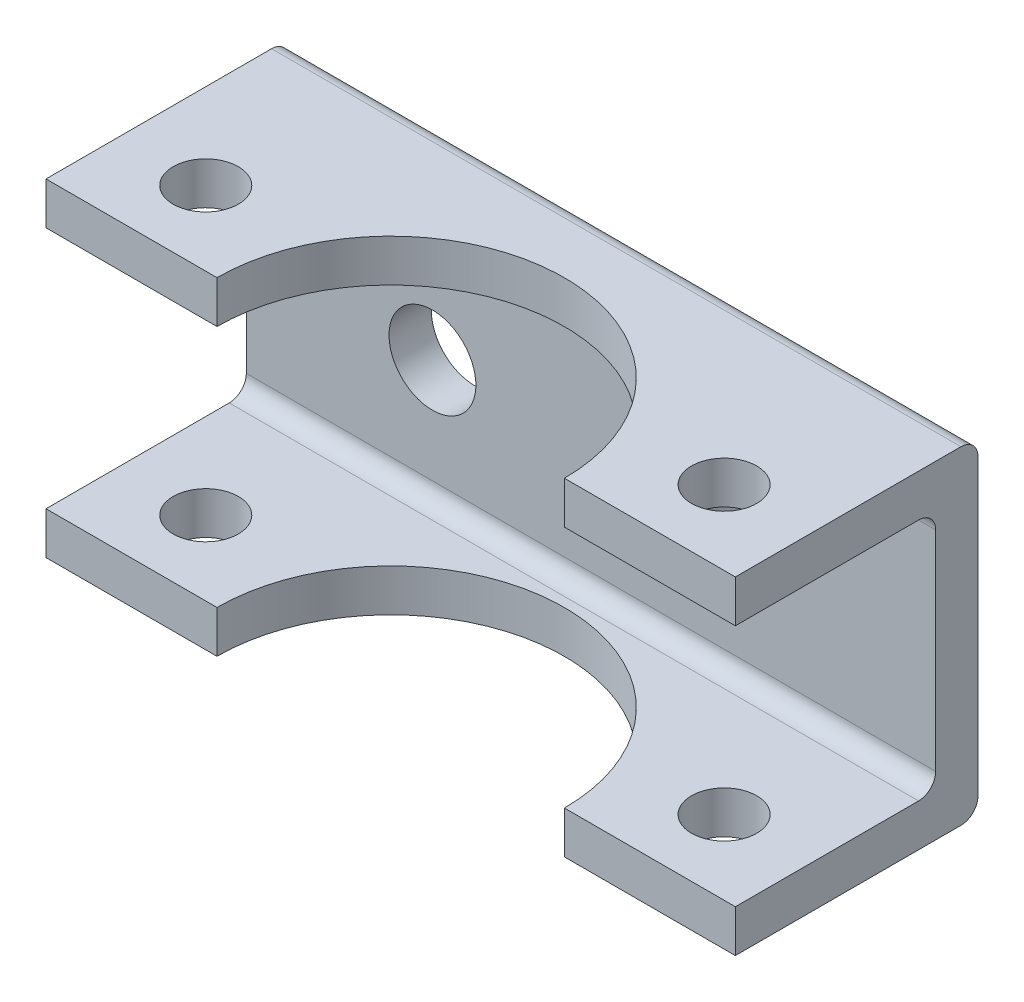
from build123d import *

# Parameters (mm, degrees)
SKETCH2_W           = 63.5
SKETCH2_H           = 26.31
BOSS_EXTRUDE1_DEPTH = 3.9
SKETCH3_W           = 63.5
SKETCH3_H           = 22.352
BOSS_EXTRUDE2_DEPTH = 3.9
FILLET1_R           = 1.5748
SKETCH8_W           = 63.5
SKETCH8_H           = 22.352
BOSS_EXTRUDE4_DEPTH = 3.9
FILLET6_R           = 1.5748
CUT_EXTRUDE4_DEPTH  = 74.786895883
SKETCH11_R          = 4
CUT_EXTRUDE5_DEPTH  = 10
SKETCH12_R          = 3
CUT_EXTRUDE6_DEPTH  = 74.786895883
FILLET7_R           = 1.5748


with BuildPart() as part:
    # Sketch2 → Boss-Extrude1 (new body)
    with BuildSketch(Plane.XY):
        with Locations((31.75, 13.155)):
            Rectangle(SKETCH2_W, SKETCH2_H)
    extrude(amount=BOSS_EXTRUDE1_DEPTH)

    # Sketch3 → Boss-Extrude2 (add)
    with BuildSketch(Plane(origin=(0, 0, 0), x_dir=(1, 0, 0), z_dir=(0, 1, 0))):
        with Locations((31.75, -11.176)):
            Rectangle(SKETCH3_W, SKETCH3_H)
    extrude(amount=BOSS_EXTRUDE2_DEPTH)

    # Fillet1
    fillet1_edges = [part.edges().sort_by_distance(p)[0] for p in [
        (31.75, 3.9, 3.9),
    ]]
    fillet(fillet1_edges, radius=FILLET1_R)

    # Sketch8 → Boss-Extrude4 (add)
    with BuildSketch(Plane(origin=(0, 26.31, 0), x_dir=(1, 0, 0), z_dir=(0, 1, 0))):
        with Locations((31.75, -11.176)):
            Rectangle(SKETCH8_W, SKETCH8_H)
    extrude(amount=BOSS_EXTRUDE4_DEPTH)

    # Fillet6
    fillet6_edges = [part.edges().sort_by_distance(p)[0] for p in [
        (31.75, 26.31, 3.9),
    ]]
    fillet(fillet6_edges, radius=FILLET6_R)

    # Sketch10 → Cut-Extrude4 (cut, through all)
    with BuildSketch(Plane(origin=(0, 30.21, 0), x_dir=(1, 0, 0), z_dir=(0, 1, 0))):
        with BuildLine():
            Line((15.75, -22.352), (47.75, -22.352))
            ThreePointArc((47.75, -22.352), (31.75, -6.352), (15.75, -22.352))
        make_face()
    extrude(amount=-CUT_EXTRUDE4_DEPTH, mode=Mode.SUBTRACT)

    # Sketch11 → Cut-Extrude5 (cut)
    with BuildSketch(Plane(origin=(0, 0, 0), x_dir=(-1, 0, 0), z_dir=(0, 0, -1))):
        with Locations((-46.355, 15.105)):
            Circle(SKETCH11_R)
        with Locations((-17.145, 15.105)):
            Circle(SKETCH11_R)
    extrude(amount=-CUT_EXTRUDE5_DEPTH, mode=Mode.SUBTRACT)

    # Sketch12 → Cut-Extrude6 (cut, through all)
    with BuildSketch(Plane(origin=(0, 30.21, 0), x_dir=(1, 0, 0), z_dir=(0, 1, 0))):
        with Locations(Location((7.875, -15.512, 0), (0, 0, 270))):
            Circle(SKETCH12_R)
        with Locations(Location((55.625, -15.512, 0), (0, 0, 270))):
            Circle(SKETCH12_R)
    extrude(amount=-CUT_EXTRUDE6_DEPTH, mode=Mode.SUBTRACT)

    # Fillet7
    fillet7_edges = [part.edges().sort_by_distance(p)[0] for p in [
        (31.75, 30.21, 0),
        (31.75, 0, 0),
    ]]
    fillet(fillet7_edges, radius=FILLET7_R)


solid = part.part
